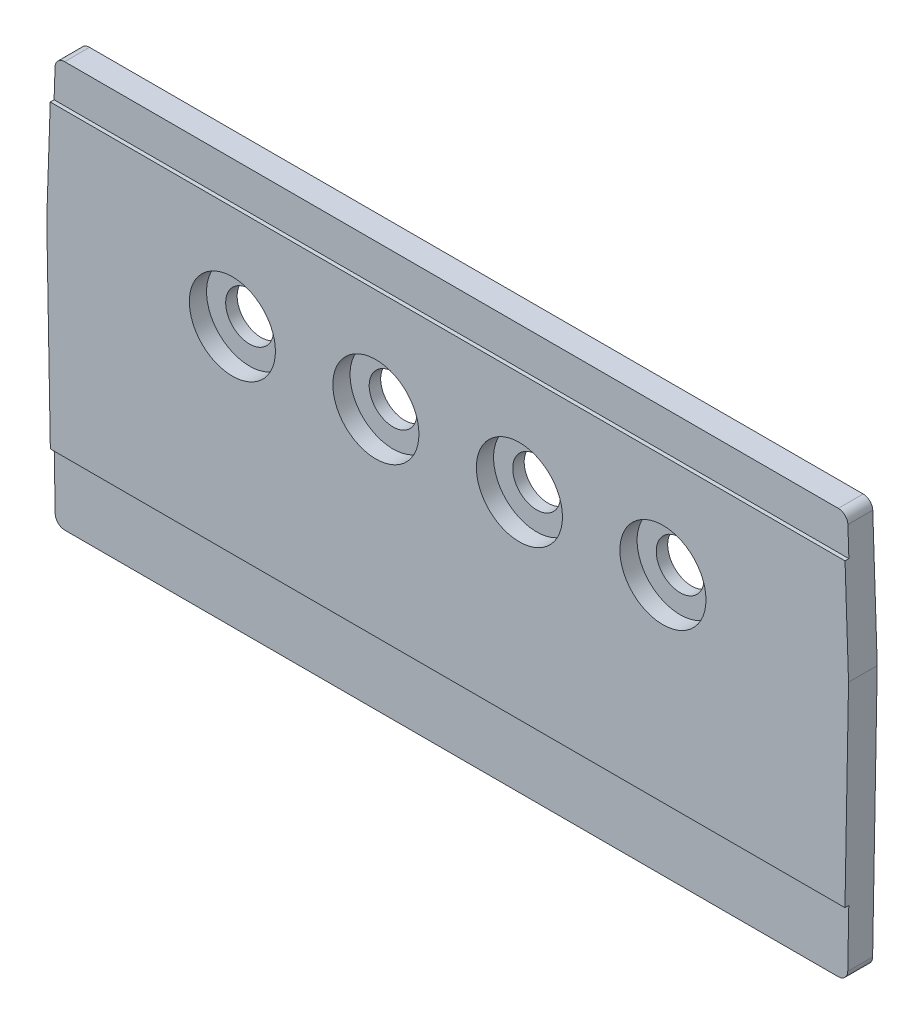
ISO-10303-21;
HEADER;
FILE_DESCRIPTION(('STEP AP214'),'2;1');
FILE_NAME('part.step','',(''),(''),'','','');
FILE_SCHEMA(('AUTOMOTIVE_DESIGN { 1 0 10303 214 1 1 1 1 }'));
ENDSEC;
DATA;
#1=APPLICATION_CONTEXT('core data for automotive mechanical design processes');
#2=APPLICATION_PROTOCOL_DEFINITION('international standard','automotive_design',2000,#1);
#3=PRODUCT_CONTEXT('',#1,'mechanical');
#4=PRODUCT('Part','Part','',(#3));
#5=PRODUCT_RELATED_PRODUCT_CATEGORY('part','',(#4));
#6=PRODUCT_DEFINITION_FORMATION('','',#4);
#7=PRODUCT_DEFINITION_CONTEXT('part definition',#1,'design');
#8=PRODUCT_DEFINITION('design','',#6,#7);
#9=PRODUCT_DEFINITION_SHAPE('','',#8);
#10=(LENGTH_UNIT() NAMED_UNIT(*) SI_UNIT(.MILLI.,.METRE.));
#11=(NAMED_UNIT(*) PLANE_ANGLE_UNIT() SI_UNIT($,.RADIAN.));
#12=(NAMED_UNIT(*) SI_UNIT($,.STERADIAN.) SOLID_ANGLE_UNIT());
#13=UNCERTAINTY_MEASURE_WITH_UNIT(LENGTH_MEASURE(1.E-05),#10,'distance_accuracy_value','');
#14=(GEOMETRIC_REPRESENTATION_CONTEXT(3) GLOBAL_UNCERTAINTY_ASSIGNED_CONTEXT((#13)) GLOBAL_UNIT_ASSIGNED_CONTEXT((#10,
#11,#12)) REPRESENTATION_CONTEXT('',''));
#15=CARTESIAN_POINT('',(0.,0.,0.));
#16=DIRECTION('',(0.,0.,1.));
#17=DIRECTION('',(1.,0.,0.));
#18=AXIS2_PLACEMENT_3D('',#15,#16,#17);
#19=CARTESIAN_POINT('',(82.3179518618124,1.,3.));
#20=DIRECTION('',(0.,0.,-1.));
#21=DIRECTION('',(-1.,0.,0.));
#22=AXIS2_PLACEMENT_3D('',#19,#20,#21);
#23=CYLINDRICAL_SURFACE('',#22,1.);
#24=CARTESIAN_POINT('',(82.3179518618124,1.,2.6));
#25=DIRECTION('',(0.,0.,1.));
#26=DIRECTION('',(1.,0.,0.));
#27=AXIS2_PLACEMENT_3D('',#24,#25,#26);
#28=CIRCLE('',#27,1.);
#29=CARTESIAN_POINT('',(82.3179518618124,0.,2.6));
#30=VERTEX_POINT('',#29);
#31=CARTESIAN_POINT('',(83.3177878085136,0.981887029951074,2.6));
#32=VERTEX_POINT('',#31);
#33=EDGE_CURVE('E143',#30,#32,#28,.T.);
#34=ORIENTED_EDGE('',*,*,#33,.F.);
#35=DIRECTION('',(0.,0.,-1.));
#36=VECTOR('',#35,1.);
#37=CARTESIAN_POINT('',(82.3179518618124,0.,3.));
#38=LINE('',#37,#36);
#39=CARTESIAN_POINT('',(82.3179518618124,0.,0.));
#40=VERTEX_POINT('',#39);
#41=EDGE_CURVE('E172',#30,#40,#38,.T.);
#42=ORIENTED_EDGE('',*,*,#41,.T.);
#43=CARTESIAN_POINT('',(82.3179518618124,1.,0.));
#44=DIRECTION('',(0.,0.,1.));
#45=DIRECTION('',(-1.,0.,0.));
#46=AXIS2_PLACEMENT_3D('',#43,#44,#45);
#47=CIRCLE('',#46,1.);
#48=CARTESIAN_POINT('',(83.3177878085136,0.981887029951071,0.));
#49=VERTEX_POINT('',#48);
#50=EDGE_CURVE('E173',#40,#49,#47,.T.);
#51=ORIENTED_EDGE('',*,*,#50,.T.);
#52=DIRECTION('',(0.,0.,-1.));
#53=VECTOR('',#52,1.);
#54=CARTESIAN_POINT('',(83.3177878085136,0.981887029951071,3.));
#55=LINE('',#54,#53);
#56=EDGE_CURVE('E214',#32,#49,#55,.T.);
#57=ORIENTED_EDGE('',*,*,#56,.F.);
#58=EDGE_LOOP('',(#34,#42,#51,#57));
#59=FACE_BOUND('',#58,.T.);
#60=ADVANCED_FACE('F33',(#59),#23,.T.);
#61=CARTESIAN_POINT('',(1.48204813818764,1.,3.));
#62=DIRECTION('',(0.,0.,-1.));
#63=DIRECTION('',(-1.,0.,0.));
#64=AXIS2_PLACEMENT_3D('',#61,#62,#63);
#65=CYLINDRICAL_SURFACE('',#64,1.);
#66=CARTESIAN_POINT('',(1.48204813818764,1.,2.6));
#67=DIRECTION('',(0.,0.,1.));
#68=DIRECTION('',(1.,0.,0.));
#69=AXIS2_PLACEMENT_3D('',#66,#67,#68);
#70=CIRCLE('',#69,1.);
#71=CARTESIAN_POINT('',(0.482212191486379,0.981887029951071,2.6));
#72=VERTEX_POINT('',#71);
#73=CARTESIAN_POINT('',(1.48204813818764,0.,2.6));
#74=VERTEX_POINT('',#73);
#75=EDGE_CURVE('E47',#72,#74,#70,.T.);
#76=ORIENTED_EDGE('',*,*,#75,.F.);
#77=DIRECTION('',(0.,0.,-1.));
#78=VECTOR('',#77,1.);
#79=CARTESIAN_POINT('',(0.482212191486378,0.981887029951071,3.));
#80=LINE('',#79,#78);
#81=CARTESIAN_POINT('',(0.482212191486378,0.981887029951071,0.));
#82=VERTEX_POINT('',#81);
#83=EDGE_CURVE('E200',#72,#82,#80,.T.);
#84=ORIENTED_EDGE('',*,*,#83,.T.);
#85=CARTESIAN_POINT('',(1.48204813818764,1.,0.));
#86=DIRECTION('',(0.,0.,1.));
#87=DIRECTION('',(1.,0.,0.));
#88=AXIS2_PLACEMENT_3D('',#85,#86,#87);
#89=CIRCLE('',#88,1.);
#90=CARTESIAN_POINT('',(1.48204813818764,0.,0.));
#91=VERTEX_POINT('',#90);
#92=EDGE_CURVE('E164',#82,#91,#89,.T.);
#93=ORIENTED_EDGE('',*,*,#92,.T.);
#94=DIRECTION('',(0.,0.,-1.));
#95=VECTOR('',#94,1.);
#96=CARTESIAN_POINT('',(1.48204813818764,0.,3.));
#97=LINE('',#96,#95);
#98=EDGE_CURVE('E198',#74,#91,#97,.T.);
#99=ORIENTED_EDGE('',*,*,#98,.F.);
#100=EDGE_LOOP('',(#76,#84,#93,#99));
#101=FACE_BOUND('',#100,.T.);
#102=ADVANCED_FACE('F354',(#101),#65,.T.);
#103=CARTESIAN_POINT('',(1.48204813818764,0.,3.));
#104=DIRECTION('',(0.,1.,0.));
#105=DIRECTION('',(0.,0.,1.));
#106=AXIS2_PLACEMENT_3D('',#103,#104,#105);
#107=PLANE('',#106);
#108=DIRECTION('',(1.,0.,0.));
#109=VECTOR('',#108,1.);
#110=CARTESIAN_POINT('',(1.48204813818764,0.,2.6));
#111=LINE('',#110,#109);
#112=EDGE_CURVE('E40',#74,#30,#111,.T.);
#113=ORIENTED_EDGE('',*,*,#112,.F.);
#114=ORIENTED_EDGE('',*,*,#98,.T.);
#115=DIRECTION('',(1.,0.,0.));
#116=VECTOR('',#115,1.);
#117=CARTESIAN_POINT('',(1.48204813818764,0.,0.));
#118=LINE('',#117,#116);
#119=EDGE_CURVE('E159',#91,#40,#118,.T.);
#120=ORIENTED_EDGE('',*,*,#119,.T.);
#121=ORIENTED_EDGE('',*,*,#41,.F.);
#122=EDGE_LOOP('',(#113,#114,#120,#121));
#123=FACE_BOUND('',#122,.T.);
#124=ADVANCED_FACE('F249',(#123),#107,.F.);
#125=CARTESIAN_POINT('',(82.3332132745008,41.4,3.));
#126=DIRECTION('',(0.,0.,-1.));
#127=DIRECTION('',(-1.,0.,0.));
#128=AXIS2_PLACEMENT_3D('',#125,#126,#127);
#129=CYLINDRICAL_SURFACE('',#128,1.);
#130=CARTESIAN_POINT('',(82.3332132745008,41.4,2.6));
#131=DIRECTION('',(0.,0.,1.));
#132=DIRECTION('',(1.,0.,0.));
#133=AXIS2_PLACEMENT_3D('',#130,#131,#132);
#134=CIRCLE('',#133,1.);
#135=CARTESIAN_POINT('',(83.3326430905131,41.4337645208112,2.6));
#136=VERTEX_POINT('',#135);
#137=CARTESIAN_POINT('',(82.3332132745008,42.4,2.6));
#138=VERTEX_POINT('',#137);
#139=EDGE_CURVE('E290',#136,#138,#134,.T.);
#140=ORIENTED_EDGE('',*,*,#139,.F.);
#141=DIRECTION('',(0.,0.,-1.));
#142=VECTOR('',#141,1.);
#143=CARTESIAN_POINT('',(83.3326430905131,41.4337645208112,3.));
#144=LINE('',#143,#142);
#145=CARTESIAN_POINT('',(83.3326430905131,41.4337645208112,0.));
#146=VERTEX_POINT('',#145);
#147=EDGE_CURVE('E211',#136,#146,#144,.T.);
#148=ORIENTED_EDGE('',*,*,#147,.T.);
#149=CARTESIAN_POINT('',(82.3332132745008,41.4,0.));
#150=DIRECTION('',(0.,0.,1.));
#151=DIRECTION('',(1.,0.,0.));
#152=AXIS2_PLACEMENT_3D('',#149,#150,#151);
#153=CIRCLE('',#152,1.);
#154=CARTESIAN_POINT('',(82.3332132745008,42.4,0.));
#155=VERTEX_POINT('',#154);
#156=EDGE_CURVE('E181',#146,#155,#153,.T.);
#157=ORIENTED_EDGE('',*,*,#156,.T.);
#158=DIRECTION('',(0.,0.,-1.));
#159=VECTOR('',#158,1.);
#160=CARTESIAN_POINT('',(82.3332132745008,42.4,3.));
#161=LINE('',#160,#159);
#162=EDGE_CURVE('E209',#138,#155,#161,.T.);
#163=ORIENTED_EDGE('',*,*,#162,.F.);
#164=EDGE_LOOP('',(#140,#148,#157,#163));
#165=FACE_BOUND('',#164,.T.);
#166=ADVANCED_FACE('F363',(#165),#129,.T.);
#167=CARTESIAN_POINT('',(1.46678672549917,42.4,3.));
#168=DIRECTION('',(0.,-1.,0.));
#169=DIRECTION('',(0.,0.,-1.));
#170=AXIS2_PLACEMENT_3D('',#167,#168,#169);
#171=PLANE('',#170);
#172=DIRECTION('',(-1.,0.,0.));
#173=VECTOR('',#172,1.);
#174=CARTESIAN_POINT('',(-0.630436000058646,42.4,2.6));
#175=LINE('',#174,#173);
#176=CARTESIAN_POINT('',(1.46678672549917,42.4,2.6));
#177=VERTEX_POINT('',#176);
#178=EDGE_CURVE('E287',#138,#177,#175,.T.);
#179=ORIENTED_EDGE('',*,*,#178,.F.);
#180=ORIENTED_EDGE('',*,*,#162,.T.);
#181=DIRECTION('',(-1.,0.,0.));
#182=VECTOR('',#181,1.);
#183=CARTESIAN_POINT('',(1.46678672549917,42.4,0.));
#184=LINE('',#183,#182);
#185=CARTESIAN_POINT('',(1.46678672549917,42.4,0.));
#186=VERTEX_POINT('',#185);
#187=EDGE_CURVE('E184',#155,#186,#184,.T.);
#188=ORIENTED_EDGE('',*,*,#187,.T.);
#189=DIRECTION('',(0.,0.,-1.));
#190=VECTOR('',#189,1.);
#191=CARTESIAN_POINT('',(1.46678672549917,42.4,3.));
#192=LINE('',#191,#190);
#193=EDGE_CURVE('E207',#177,#186,#192,.T.);
#194=ORIENTED_EDGE('',*,*,#193,.F.);
#195=EDGE_LOOP('',(#179,#180,#188,#194));
#196=FACE_BOUND('',#195,.T.);
#197=ADVANCED_FACE('F374',(#196),#171,.F.);
#198=CARTESIAN_POINT('',(1.46678672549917,41.4,3.));
#199=DIRECTION('',(0.,0.,-1.));
#200=DIRECTION('',(-1.,0.,0.));
#201=AXIS2_PLACEMENT_3D('',#198,#199,#200);
#202=CYLINDRICAL_SURFACE('',#201,1.);
#203=CARTESIAN_POINT('',(1.46678672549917,41.4,2.6));
#204=DIRECTION('',(0.,0.,1.));
#205=DIRECTION('',(1.,0.,0.));
#206=AXIS2_PLACEMENT_3D('',#203,#204,#205);
#207=CIRCLE('',#206,1.);
#208=CARTESIAN_POINT('',(0.467356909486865,41.4337645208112,2.6));
#209=VERTEX_POINT('',#208);
#210=EDGE_CURVE('E55',#177,#209,#207,.T.);
#211=ORIENTED_EDGE('',*,*,#210,.F.);
#212=ORIENTED_EDGE('',*,*,#193,.T.);
#213=CARTESIAN_POINT('',(1.46678672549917,41.4,0.));
#214=DIRECTION('',(0.,0.,1.));
#215=DIRECTION('',(-1.,0.,0.));
#216=AXIS2_PLACEMENT_3D('',#213,#214,#215);
#217=CIRCLE('',#216,1.);
#218=CARTESIAN_POINT('',(0.467356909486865,41.4337645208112,0.));
#219=VERTEX_POINT('',#218);
#220=EDGE_CURVE('E187',#186,#219,#217,.T.);
#221=ORIENTED_EDGE('',*,*,#220,.T.);
#222=DIRECTION('',(0.,0.,-1.));
#223=VECTOR('',#222,1.);
#224=CARTESIAN_POINT('',(0.467356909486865,41.4337645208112,3.));
#225=LINE('',#224,#223);
#226=EDGE_CURVE('E205',#209,#219,#225,.T.);
#227=ORIENTED_EDGE('',*,*,#226,.F.);
#228=EDGE_LOOP('',(#211,#212,#221,#227));
#229=FACE_BOUND('',#228,.T.);
#230=ADVANCED_FACE('F370',(#229),#202,.T.);
#231=CARTESIAN_POINT('',(64.4,27.6,3.));
#232=DIRECTION('',(0.,0.,-1.));
#233=DIRECTION('',(-1.,0.,0.));
#234=AXIS2_PLACEMENT_3D('',#231,#232,#233);
#235=CYLINDRICAL_SURFACE('',#234,2.50000000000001);
#236=CARTESIAN_POINT('',(64.4,27.6,0.));
#237=DIRECTION('',(0.,0.,1.));
#238=DIRECTION('',(1.,0.,0.));
#239=AXIS2_PLACEMENT_3D('',#236,#237,#238);
#240=CIRCLE('',#239,2.50000000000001);
#241=CARTESIAN_POINT('',(66.9,27.6,0.));
#242=VERTEX_POINT('',#241);
#243=EDGE_CURVE('E220',#242,#242,#240,.T.);
#244=ORIENTED_EDGE('',*,*,#243,.F.);
#245=EDGE_LOOP('',(#244));
#246=FACE_BOUND('',#245,.T.);
#247=CARTESIAN_POINT('',(64.4,27.6,1.2));
#248=DIRECTION('',(0.,0.,1.));
#249=DIRECTION('',(1.,0.,0.));
#250=AXIS2_PLACEMENT_3D('',#247,#248,#249);
#251=CIRCLE('',#250,2.50000000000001);
#252=CARTESIAN_POINT('',(66.9,27.6,1.2));
#253=VERTEX_POINT('',#252);
#254=EDGE_CURVE('E232',#253,#253,#251,.T.);
#255=ORIENTED_EDGE('',*,*,#254,.T.);
#256=EDGE_LOOP('',(#255));
#257=FACE_BOUND('',#256,.T.);
#258=ADVANCED_FACE('F373',(#246,#257),#235,.F.);
#259=CARTESIAN_POINT('',(49.4,27.6,3.));
#260=DIRECTION('',(0.,0.,-1.));
#261=DIRECTION('',(-1.,0.,0.));
#262=AXIS2_PLACEMENT_3D('',#259,#260,#261);
#263=CYLINDRICAL_SURFACE('',#262,2.5);
#264=CARTESIAN_POINT('',(49.4,27.6,0.));
#265=DIRECTION('',(0.,0.,1.));
#266=DIRECTION('',(1.,0.,0.));
#267=AXIS2_PLACEMENT_3D('',#264,#265,#266);
#268=CIRCLE('',#267,2.5);
#269=CARTESIAN_POINT('',(51.9,27.6,0.));
#270=VERTEX_POINT('',#269);
#271=EDGE_CURVE('E314',#270,#270,#268,.T.);
#272=ORIENTED_EDGE('',*,*,#271,.F.);
#273=EDGE_LOOP('',(#272));
#274=FACE_BOUND('',#273,.T.);
#275=CARTESIAN_POINT('',(49.4,27.6,1.2));
#276=DIRECTION('',(0.,0.,1.));
#277=DIRECTION('',(1.,0.,0.));
#278=AXIS2_PLACEMENT_3D('',#275,#276,#277);
#279=CIRCLE('',#278,2.5);
#280=CARTESIAN_POINT('',(51.9,27.6,1.2));
#281=VERTEX_POINT('',#280);
#282=EDGE_CURVE('E227',#281,#281,#279,.T.);
#283=ORIENTED_EDGE('',*,*,#282,.T.);
#284=EDGE_LOOP('',(#283));
#285=FACE_BOUND('',#284,.T.);
#286=ADVANCED_FACE('F542',(#274,#285),#263,.F.);
#287=CARTESIAN_POINT('',(34.4,27.6,3.));
#288=DIRECTION('',(0.,0.,-1.));
#289=DIRECTION('',(-1.,0.,0.));
#290=AXIS2_PLACEMENT_3D('',#287,#288,#289);
#291=CYLINDRICAL_SURFACE('',#290,2.5);
#292=CARTESIAN_POINT('',(34.4,27.6,0.));
#293=DIRECTION('',(0.,0.,1.));
#294=DIRECTION('',(1.,0.,0.));
#295=AXIS2_PLACEMENT_3D('',#292,#293,#294);
#296=CIRCLE('',#295,2.5);
#297=CARTESIAN_POINT('',(36.9,27.6,0.));
#298=VERTEX_POINT('',#297);
#299=EDGE_CURVE('E316',#298,#298,#296,.T.);
#300=ORIENTED_EDGE('',*,*,#299,.F.);
#301=EDGE_LOOP('',(#300));
#302=FACE_BOUND('',#301,.T.);
#303=CARTESIAN_POINT('',(34.4,27.6,1.2));
#304=DIRECTION('',(0.,0.,1.));
#305=DIRECTION('',(1.,0.,0.));
#306=AXIS2_PLACEMENT_3D('',#303,#304,#305);
#307=CIRCLE('',#306,2.5);
#308=CARTESIAN_POINT('',(36.9,27.6,1.2));
#309=VERTEX_POINT('',#308);
#310=EDGE_CURVE('E222',#309,#309,#307,.T.);
#311=ORIENTED_EDGE('',*,*,#310,.T.);
#312=EDGE_LOOP('',(#311));
#313=FACE_BOUND('',#312,.T.);
#314=ADVANCED_FACE('F326',(#302,#313),#291,.F.);
#315=CARTESIAN_POINT('',(19.4,27.6,3.));
#316=DIRECTION('',(0.,0.,-1.));
#317=DIRECTION('',(-1.,0.,0.));
#318=AXIS2_PLACEMENT_3D('',#315,#316,#317);
#319=CYLINDRICAL_SURFACE('',#318,2.5);
#320=CARTESIAN_POINT('',(19.4,27.6,0.));
#321=DIRECTION('',(0.,0.,1.));
#322=DIRECTION('',(1.,0.,0.));
#323=AXIS2_PLACEMENT_3D('',#320,#321,#322);
#324=CIRCLE('',#323,2.5);
#325=CARTESIAN_POINT('',(21.9,27.6,0.));
#326=VERTEX_POINT('',#325);
#327=EDGE_CURVE('E167',#326,#326,#324,.T.);
#328=ORIENTED_EDGE('',*,*,#327,.F.);
#329=EDGE_LOOP('',(#328));
#330=FACE_BOUND('',#329,.T.);
#331=CARTESIAN_POINT('',(19.4,27.6,1.2));
#332=DIRECTION('',(0.,0.,1.));
#333=DIRECTION('',(1.,0.,0.));
#334=AXIS2_PLACEMENT_3D('',#331,#332,#333);
#335=CIRCLE('',#334,2.5);
#336=CARTESIAN_POINT('',(21.9,27.6,1.2));
#337=VERTEX_POINT('',#336);
#338=EDGE_CURVE('E217',#337,#337,#335,.T.);
#339=ORIENTED_EDGE('',*,*,#338,.T.);
#340=EDGE_LOOP('',(#339));
#341=FACE_BOUND('',#340,.T.);
#342=ADVANCED_FACE('F323',(#330,#341),#319,.F.);
#343=CARTESIAN_POINT('',(82.3179518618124,1.,3.));
#344=DIRECTION('',(0.,0.,-1.));
#345=DIRECTION('',(-1.,0.,0.));
#346=AXIS2_PLACEMENT_3D('',#343,#344,#345);
#347=PLANE('',#346);
#348=CARTESIAN_POINT('',(64.4,27.6,3.));
#349=DIRECTION('',(0.,0.,1.));
#350=DIRECTION('',(1.,0.,0.));
#351=AXIS2_PLACEMENT_3D('',#348,#349,#350);
#352=CIRCLE('',#351,4.5);
#353=CARTESIAN_POINT('',(68.9,27.6,3.));
#354=VERTEX_POINT('',#353);
#355=EDGE_CURVE('E295',#354,#354,#352,.T.);
#356=ORIENTED_EDGE('',*,*,#355,.F.);
#357=EDGE_LOOP('',(#356));
#358=FACE_BOUND('',#357,.T.);
#359=CARTESIAN_POINT('',(49.4,27.6,3.));
#360=DIRECTION('',(0.,0.,1.));
#361=DIRECTION('',(1.,0.,0.));
#362=AXIS2_PLACEMENT_3D('',#359,#360,#361);
#363=CIRCLE('',#362,4.5);
#364=CARTESIAN_POINT('',(53.9,27.6,3.));
#365=VERTEX_POINT('',#364);
#366=EDGE_CURVE('E235',#365,#365,#363,.T.);
#367=ORIENTED_EDGE('',*,*,#366,.F.);
#368=EDGE_LOOP('',(#367));
#369=FACE_BOUND('',#368,.T.);
#370=CARTESIAN_POINT('',(34.4,27.6,3.));
#371=DIRECTION('',(0.,0.,1.));
#372=DIRECTION('',(1.,0.,0.));
#373=AXIS2_PLACEMENT_3D('',#370,#371,#372);
#374=CIRCLE('',#373,4.5);
#375=CARTESIAN_POINT('',(38.9,27.6,3.));
#376=VERTEX_POINT('',#375);
#377=EDGE_CURVE('E230',#376,#376,#374,.T.);
#378=ORIENTED_EDGE('',*,*,#377,.F.);
#379=EDGE_LOOP('',(#378));
#380=FACE_BOUND('',#379,.T.);
#381=CARTESIAN_POINT('',(19.4,27.6,3.));
#382=DIRECTION('',(0.,0.,1.));
#383=DIRECTION('',(1.,0.,0.));
#384=AXIS2_PLACEMENT_3D('',#381,#382,#383);
#385=CIRCLE('',#384,4.5);
#386=CARTESIAN_POINT('',(23.9,27.6,3.));
#387=VERTEX_POINT('',#386);
#388=EDGE_CURVE('E225',#387,#387,#385,.T.);
#389=ORIENTED_EDGE('',*,*,#388,.F.);
#390=EDGE_LOOP('',(#389));
#391=FACE_BOUND('',#390,.T.);
#392=DIRECTION('',(0.0181129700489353,-0.999835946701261,0.));
#393=VECTOR('',#392,1.);
#394=CARTESIAN_POINT('',(0.,27.6,3.));
#395=LINE('',#394,#393);
#396=CARTESIAN_POINT('',(0.,27.6,3.));
#397=VERTEX_POINT('',#396);
#398=CARTESIAN_POINT('',(0.37318840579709,6.99999999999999,3.));
#399=VERTEX_POINT('',#398);
#400=EDGE_CURVE('E152',#397,#399,#395,.T.);
#401=ORIENTED_EDGE('',*,*,#400,.T.);
#402=DIRECTION('',(-1.,0.,0.));
#403=VECTOR('',#402,1.);
#404=CARTESIAN_POINT('',(-0.630436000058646,6.99999999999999,3.));
#405=LINE('',#404,#403);
#406=CARTESIAN_POINT('',(83.4268115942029,6.99999999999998,3.));
#407=VERTEX_POINT('',#406);
#408=EDGE_CURVE('E136',#407,#399,#405,.T.);
#409=ORIENTED_EDGE('',*,*,#408,.F.);
#410=DIRECTION('',(0.0181129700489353,0.999835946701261,0.));
#411=VECTOR('',#410,1.);
#412=CARTESIAN_POINT('',(83.8,27.6,3.));
#413=LINE('',#412,#411);
#414=CARTESIAN_POINT('',(83.8,27.6,3.));
#415=VERTEX_POINT('',#414);
#416=EDGE_CURVE('E149',#407,#415,#413,.T.);
#417=ORIENTED_EDGE('',*,*,#416,.T.);
#418=DIRECTION('',(-0.0337645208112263,0.999429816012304,0.));
#419=VECTOR('',#418,1.);
#420=CARTESIAN_POINT('',(83.3326430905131,41.4337645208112,3.));
#421=LINE('',#420,#419);
#422=CARTESIAN_POINT('',(83.4351351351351,38.4,3.));
#423=VERTEX_POINT('',#422);
#424=EDGE_CURVE('E158',#415,#423,#421,.T.);
#425=ORIENTED_EDGE('',*,*,#424,.T.);
#426=DIRECTION('',(1.,0.,0.));
#427=VECTOR('',#426,1.);
#428=CARTESIAN_POINT('',(-0.630436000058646,38.4,3.));
#429=LINE('',#428,#427);
#430=CARTESIAN_POINT('',(0.364864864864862,38.4,3.));
#431=VERTEX_POINT('',#430);
#432=EDGE_CURVE('E142',#431,#423,#429,.T.);
#433=ORIENTED_EDGE('',*,*,#432,.F.);
#434=DIRECTION('',(-0.0337645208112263,-0.999429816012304,0.));
#435=VECTOR('',#434,1.);
#436=CARTESIAN_POINT('',(0.467356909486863,41.4337645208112,3.));
#437=LINE('',#436,#435);
#438=EDGE_CURVE('E161',#431,#397,#437,.T.);
#439=ORIENTED_EDGE('',*,*,#438,.T.);
#440=EDGE_LOOP('',(#401,#409,#417,#425,#433,#439));
#441=FACE_BOUND('',#440,.T.);
#442=ADVANCED_FACE('F147',(#358,#369,#380,#391,#441),#347,.F.);
#443=CARTESIAN_POINT('',(82.3179518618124,1.,0.));
#444=DIRECTION('',(0.,0.,-1.));
#445=DIRECTION('',(-1.,0.,0.));
#446=AXIS2_PLACEMENT_3D('',#443,#444,#445);
#447=PLANE('',#446);
#448=ORIENTED_EDGE('',*,*,#271,.T.);
#449=EDGE_LOOP('',(#448));
#450=FACE_BOUND('',#449,.T.);
#451=ORIENTED_EDGE('',*,*,#327,.T.);
#452=EDGE_LOOP('',(#451));
#453=FACE_BOUND('',#452,.T.);
#454=ORIENTED_EDGE('',*,*,#50,.F.);
#455=ORIENTED_EDGE('',*,*,#119,.F.);
#456=ORIENTED_EDGE('',*,*,#92,.F.);
#457=DIRECTION('',(0.0181129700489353,-0.999835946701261,0.));
#458=VECTOR('',#457,1.);
#459=CARTESIAN_POINT('',(0.,27.6,0.));
#460=LINE('',#459,#458);
#461=CARTESIAN_POINT('',(0.,27.6,0.));
#462=VERTEX_POINT('',#461);
#463=EDGE_CURVE('E192',#462,#82,#460,.T.);
#464=ORIENTED_EDGE('',*,*,#463,.F.);
#465=DIRECTION('',(-0.0337645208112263,-0.999429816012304,0.));
#466=VECTOR('',#465,1.);
#467=CARTESIAN_POINT('',(0.467356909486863,41.4337645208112,0.));
#468=LINE('',#467,#466);
#469=EDGE_CURVE('E190',#219,#462,#468,.T.);
#470=ORIENTED_EDGE('',*,*,#469,.F.);
#471=ORIENTED_EDGE('',*,*,#220,.F.);
#472=ORIENTED_EDGE('',*,*,#187,.F.);
#473=ORIENTED_EDGE('',*,*,#156,.F.);
#474=DIRECTION('',(-0.0337645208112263,0.999429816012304,0.));
#475=VECTOR('',#474,1.);
#476=CARTESIAN_POINT('',(83.3326430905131,41.4337645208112,0.));
#477=LINE('',#476,#475);
#478=CARTESIAN_POINT('',(83.8,27.6,0.));
#479=VERTEX_POINT('',#478);
#480=EDGE_CURVE('E178',#479,#146,#477,.T.);
#481=ORIENTED_EDGE('',*,*,#480,.F.);
#482=DIRECTION('',(0.0181129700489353,0.999835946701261,0.));
#483=VECTOR('',#482,1.);
#484=CARTESIAN_POINT('',(83.8,27.6,0.));
#485=LINE('',#484,#483);
#486=EDGE_CURVE('E176',#49,#479,#485,.T.);
#487=ORIENTED_EDGE('',*,*,#486,.F.);
#488=EDGE_LOOP('',(#454,#455,#456,#464,#470,#471,#472,#473,#481,#487));
#489=FACE_BOUND('',#488,.T.);
#490=ORIENTED_EDGE('',*,*,#299,.T.);
#491=EDGE_LOOP('',(#490));
#492=FACE_BOUND('',#491,.T.);
#493=ORIENTED_EDGE('',*,*,#243,.T.);
#494=EDGE_LOOP('',(#493));
#495=FACE_BOUND('',#494,.T.);
#496=ADVANCED_FACE('F255',(#450,#453,#489,#492,#495),#447,.T.);
#497=CARTESIAN_POINT('',(83.8,27.6,3.));
#498=DIRECTION('',(-0.999835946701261,0.0181129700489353,0.));
#499=DIRECTION('',(-0.0181129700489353,-0.999835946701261,0.));
#500=AXIS2_PLACEMENT_3D('',#497,#498,#499);
#501=PLANE('',#500);
#502=ORIENTED_EDGE('',*,*,#416,.F.);
#503=DIRECTION('',(0.,0.,-1.));
#504=VECTOR('',#503,1.);
#505=CARTESIAN_POINT('',(83.4268115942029,6.99999999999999,3.));
#506=LINE('',#505,#504);
#507=CARTESIAN_POINT('',(83.4268115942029,6.99999999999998,2.6));
#508=VERTEX_POINT('',#507);
#509=EDGE_CURVE('E133',#407,#508,#506,.T.);
#510=ORIENTED_EDGE('',*,*,#509,.T.);
#511=DIRECTION('',(0.0181129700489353,0.999835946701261,0.));
#512=VECTOR('',#511,1.);
#513=CARTESIAN_POINT('',(83.8,27.6,2.6));
#514=LINE('',#513,#512);
#515=EDGE_CURVE('E247',#32,#508,#514,.T.);
#516=ORIENTED_EDGE('',*,*,#515,.F.);
#517=ORIENTED_EDGE('',*,*,#56,.T.);
#518=ORIENTED_EDGE('',*,*,#486,.T.);
#519=DIRECTION('',(0.,0.,-1.));
#520=VECTOR('',#519,1.);
#521=CARTESIAN_POINT('',(83.8,27.6,3.));
#522=LINE('',#521,#520);
#523=EDGE_CURVE('E156',#415,#479,#522,.T.);
#524=ORIENTED_EDGE('',*,*,#523,.F.);
#525=EDGE_LOOP('',(#502,#510,#516,#517,#518,#524));
#526=FACE_BOUND('',#525,.T.);
#527=ADVANCED_FACE('F154',(#526),#501,.F.);
#528=CARTESIAN_POINT('',(83.3326430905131,41.4337645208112,3.));
#529=DIRECTION('',(-0.999429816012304,-0.0337645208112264,0.));
#530=DIRECTION('',(0.0337645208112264,-0.999429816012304,0.));
#531=AXIS2_PLACEMENT_3D('',#528,#529,#530);
#532=PLANE('',#531);
#533=DIRECTION('',(-0.0337645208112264,0.999429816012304,0.));
#534=VECTOR('',#533,1.);
#535=CARTESIAN_POINT('',(83.3326430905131,41.4337645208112,2.6));
#536=LINE('',#535,#534);
#537=CARTESIAN_POINT('',(83.4351351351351,38.4,2.6));
#538=VERTEX_POINT('',#537);
#539=EDGE_CURVE('E292',#538,#136,#536,.T.);
#540=ORIENTED_EDGE('',*,*,#539,.F.);
#541=DIRECTION('',(0.,0.,1.));
#542=VECTOR('',#541,1.);
#543=CARTESIAN_POINT('',(83.4351351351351,38.4,3.));
#544=LINE('',#543,#542);
#545=EDGE_CURVE('E264',#538,#423,#544,.T.);
#546=ORIENTED_EDGE('',*,*,#545,.T.);
#547=ORIENTED_EDGE('',*,*,#424,.F.);
#548=ORIENTED_EDGE('',*,*,#523,.T.);
#549=ORIENTED_EDGE('',*,*,#480,.T.);
#550=ORIENTED_EDGE('',*,*,#147,.F.);
#551=EDGE_LOOP('',(#540,#546,#547,#548,#549,#550));
#552=FACE_BOUND('',#551,.T.);
#553=ADVANCED_FACE('F261',(#552),#532,.F.);
#554=CARTESIAN_POINT('',(0.467356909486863,41.4337645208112,3.));
#555=DIRECTION('',(0.999429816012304,-0.0337645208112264,0.));
#556=DIRECTION('',(0.0337645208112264,0.999429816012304,0.));
#557=AXIS2_PLACEMENT_3D('',#554,#555,#556);
#558=PLANE('',#557);
#559=ORIENTED_EDGE('',*,*,#438,.F.);
#560=DIRECTION('',(0.,0.,-1.));
#561=VECTOR('',#560,1.);
#562=CARTESIAN_POINT('',(0.364864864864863,38.4,3.));
#563=LINE('',#562,#561);
#564=CARTESIAN_POINT('',(0.364864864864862,38.4,2.6));
#565=VERTEX_POINT('',#564);
#566=EDGE_CURVE('E238',#431,#565,#563,.T.);
#567=ORIENTED_EDGE('',*,*,#566,.T.);
#568=DIRECTION('',(-0.0337645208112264,-0.999429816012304,0.));
#569=VECTOR('',#568,1.);
#570=CARTESIAN_POINT('',(0.467356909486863,41.4337645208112,2.6));
#571=LINE('',#570,#569);
#572=EDGE_CURVE('E216',#209,#565,#571,.T.);
#573=ORIENTED_EDGE('',*,*,#572,.F.);
#574=ORIENTED_EDGE('',*,*,#226,.T.);
#575=ORIENTED_EDGE('',*,*,#469,.T.);
#576=DIRECTION('',(0.,0.,-1.));
#577=VECTOR('',#576,1.);
#578=CARTESIAN_POINT('',(0.,27.6,3.));
#579=LINE('',#578,#577);
#580=EDGE_CURVE('E202',#397,#462,#579,.T.);
#581=ORIENTED_EDGE('',*,*,#580,.F.);
#582=EDGE_LOOP('',(#559,#567,#573,#574,#575,#581));
#583=FACE_BOUND('',#582,.T.);
#584=ADVANCED_FACE('F272',(#583),#558,.F.);
#585=CARTESIAN_POINT('',(0.,27.6,3.));
#586=DIRECTION('',(0.999835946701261,0.0181129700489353,0.));
#587=DIRECTION('',(-0.0181129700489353,0.999835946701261,0.));
#588=AXIS2_PLACEMENT_3D('',#585,#586,#587);
#589=PLANE('',#588);
#590=DIRECTION('',(0.0181129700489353,-0.999835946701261,0.));
#591=VECTOR('',#590,1.);
#592=CARTESIAN_POINT('',(0.,27.6,2.6));
#593=LINE('',#592,#591);
#594=CARTESIAN_POINT('',(0.37318840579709,6.99999999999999,2.6));
#595=VERTEX_POINT('',#594);
#596=EDGE_CURVE('E279',#595,#72,#593,.T.);
#597=ORIENTED_EDGE('',*,*,#596,.F.);
#598=DIRECTION('',(0.,0.,1.));
#599=VECTOR('',#598,1.);
#600=CARTESIAN_POINT('',(0.37318840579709,6.99999999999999,3.));
#601=LINE('',#600,#599);
#602=EDGE_CURVE('E11',#595,#399,#601,.T.);
#603=ORIENTED_EDGE('',*,*,#602,.T.);
#604=ORIENTED_EDGE('',*,*,#400,.F.);
#605=ORIENTED_EDGE('',*,*,#580,.T.);
#606=ORIENTED_EDGE('',*,*,#463,.T.);
#607=ORIENTED_EDGE('',*,*,#83,.F.);
#608=EDGE_LOOP('',(#597,#603,#604,#605,#606,#607));
#609=FACE_BOUND('',#608,.T.);
#610=ADVANCED_FACE('F277',(#609),#589,.F.);
#611=CARTESIAN_POINT('',(19.4,27.6,1.2));
#612=DIRECTION('',(0.,0.,1.));
#613=DIRECTION('',(1.,0.,0.));
#614=AXIS2_PLACEMENT_3D('',#611,#612,#613);
#615=CYLINDRICAL_SURFACE('',#614,4.5);
#616=CARTESIAN_POINT('',(19.4,27.6,1.2));
#617=DIRECTION('',(0.,0.,1.));
#618=DIRECTION('',(1.,0.,0.));
#619=AXIS2_PLACEMENT_3D('',#616,#617,#618);
#620=CIRCLE('',#619,4.5);
#621=CARTESIAN_POINT('',(23.9,27.6,1.2));
#622=VERTEX_POINT('',#621);
#623=EDGE_CURVE('E221',#622,#622,#620,.T.);
#624=ORIENTED_EDGE('',*,*,#623,.F.);
#625=EDGE_LOOP('',(#624));
#626=FACE_BOUND('',#625,.T.);
#627=ORIENTED_EDGE('',*,*,#388,.T.);
#628=EDGE_LOOP('',(#627));
#629=FACE_BOUND('',#628,.T.);
#630=ADVANCED_FACE('F334',(#626,#629),#615,.F.);
#631=CARTESIAN_POINT('',(19.4,27.6,1.2));
#632=DIRECTION('',(0.,0.,1.));
#633=DIRECTION('',(1.,0.,0.));
#634=AXIS2_PLACEMENT_3D('',#631,#632,#633);
#635=PLANE('',#634);
#636=ORIENTED_EDGE('',*,*,#338,.F.);
#637=EDGE_LOOP('',(#636));
#638=FACE_BOUND('',#637,.T.);
#639=ORIENTED_EDGE('',*,*,#623,.T.);
#640=EDGE_LOOP('',(#639));
#641=FACE_BOUND('',#640,.T.);
#642=ADVANCED_FACE('F330',(#638,#641),#635,.T.);
#643=CARTESIAN_POINT('',(34.4,27.6,1.2));
#644=DIRECTION('',(0.,0.,1.));
#645=DIRECTION('',(1.,0.,0.));
#646=AXIS2_PLACEMENT_3D('',#643,#644,#645);
#647=CYLINDRICAL_SURFACE('',#646,4.5);
#648=CARTESIAN_POINT('',(34.4,27.6,1.2));
#649=DIRECTION('',(0.,0.,1.));
#650=DIRECTION('',(1.,0.,0.));
#651=AXIS2_PLACEMENT_3D('',#648,#649,#650);
#652=CIRCLE('',#651,4.5);
#653=CARTESIAN_POINT('',(38.9,27.6,1.2));
#654=VERTEX_POINT('',#653);
#655=EDGE_CURVE('E226',#654,#654,#652,.T.);
#656=ORIENTED_EDGE('',*,*,#655,.F.);
#657=EDGE_LOOP('',(#656));
#658=FACE_BOUND('',#657,.T.);
#659=ORIENTED_EDGE('',*,*,#377,.T.);
#660=EDGE_LOOP('',(#659));
#661=FACE_BOUND('',#660,.T.);
#662=ADVANCED_FACE('F333',(#658,#661),#647,.F.);
#663=CARTESIAN_POINT('',(34.4,27.6,1.2));
#664=DIRECTION('',(0.,0.,1.));
#665=DIRECTION('',(1.,0.,0.));
#666=AXIS2_PLACEMENT_3D('',#663,#664,#665);
#667=PLANE('',#666);
#668=ORIENTED_EDGE('',*,*,#310,.F.);
#669=EDGE_LOOP('',(#668));
#670=FACE_BOUND('',#669,.T.);
#671=ORIENTED_EDGE('',*,*,#655,.T.);
#672=EDGE_LOOP('',(#671));
#673=FACE_BOUND('',#672,.T.);
#674=ADVANCED_FACE('F416',(#670,#673),#667,.T.);
#675=CARTESIAN_POINT('',(49.4,27.6,1.2));
#676=DIRECTION('',(0.,0.,1.));
#677=DIRECTION('',(1.,0.,0.));
#678=AXIS2_PLACEMENT_3D('',#675,#676,#677);
#679=CYLINDRICAL_SURFACE('',#678,4.5);
#680=CARTESIAN_POINT('',(49.4,27.6,1.2));
#681=DIRECTION('',(0.,0.,1.));
#682=DIRECTION('',(1.,0.,0.));
#683=AXIS2_PLACEMENT_3D('',#680,#681,#682);
#684=CIRCLE('',#683,4.5);
#685=CARTESIAN_POINT('',(53.9,27.6,1.2));
#686=VERTEX_POINT('',#685);
#687=EDGE_CURVE('E231',#686,#686,#684,.T.);
#688=ORIENTED_EDGE('',*,*,#687,.F.);
#689=EDGE_LOOP('',(#688));
#690=FACE_BOUND('',#689,.T.);
#691=ORIENTED_EDGE('',*,*,#366,.T.);
#692=EDGE_LOOP('',(#691));
#693=FACE_BOUND('',#692,.T.);
#694=ADVANCED_FACE('F424',(#690,#693),#679,.F.);
#695=CARTESIAN_POINT('',(49.4,27.6,1.2));
#696=DIRECTION('',(0.,0.,1.));
#697=DIRECTION('',(1.,0.,0.));
#698=AXIS2_PLACEMENT_3D('',#695,#696,#697);
#699=PLANE('',#698);
#700=ORIENTED_EDGE('',*,*,#282,.F.);
#701=EDGE_LOOP('',(#700));
#702=FACE_BOUND('',#701,.T.);
#703=ORIENTED_EDGE('',*,*,#687,.T.);
#704=EDGE_LOOP('',(#703));
#705=FACE_BOUND('',#704,.T.);
#706=ADVANCED_FACE('F432',(#702,#705),#699,.T.);
#707=CARTESIAN_POINT('',(64.4,27.6,1.2));
#708=DIRECTION('',(0.,0.,1.));
#709=DIRECTION('',(1.,0.,0.));
#710=AXIS2_PLACEMENT_3D('',#707,#708,#709);
#711=CYLINDRICAL_SURFACE('',#710,4.5);
#712=CARTESIAN_POINT('',(64.4,27.6,1.2));
#713=DIRECTION('',(0.,0.,1.));
#714=DIRECTION('',(1.,0.,0.));
#715=AXIS2_PLACEMENT_3D('',#712,#713,#714);
#716=CIRCLE('',#715,4.5);
#717=CARTESIAN_POINT('',(68.9,27.6,1.2));
#718=VERTEX_POINT('',#717);
#719=EDGE_CURVE('E236',#718,#718,#716,.T.);
#720=ORIENTED_EDGE('',*,*,#719,.F.);
#721=EDGE_LOOP('',(#720));
#722=FACE_BOUND('',#721,.T.);
#723=ORIENTED_EDGE('',*,*,#355,.T.);
#724=EDGE_LOOP('',(#723));
#725=FACE_BOUND('',#724,.T.);
#726=ADVANCED_FACE('F440',(#722,#725),#711,.F.);
#727=CARTESIAN_POINT('',(64.4,27.6,1.2));
#728=DIRECTION('',(0.,0.,1.));
#729=DIRECTION('',(1.,0.,0.));
#730=AXIS2_PLACEMENT_3D('',#727,#728,#729);
#731=PLANE('',#730);
#732=ORIENTED_EDGE('',*,*,#254,.F.);
#733=EDGE_LOOP('',(#732));
#734=FACE_BOUND('',#733,.T.);
#735=ORIENTED_EDGE('',*,*,#719,.T.);
#736=EDGE_LOOP('',(#735));
#737=FACE_BOUND('',#736,.T.);
#738=ADVANCED_FACE('F448',(#734,#737),#731,.T.);
#739=CARTESIAN_POINT('',(-0.630436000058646,38.4,2.6));
#740=DIRECTION('',(0.,-1.,0.));
#741=DIRECTION('',(0.,0.,-1.));
#742=AXIS2_PLACEMENT_3D('',#739,#740,#741);
#743=PLANE('',#742);
#744=DIRECTION('',(1.,0.,0.));
#745=VECTOR('',#744,1.);
#746=CARTESIAN_POINT('',(-0.630436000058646,38.4,2.6));
#747=LINE('',#746,#745);
#748=EDGE_CURVE('E269',#565,#538,#747,.T.);
#749=ORIENTED_EDGE('',*,*,#748,.F.);
#750=ORIENTED_EDGE('',*,*,#566,.F.);
#751=ORIENTED_EDGE('',*,*,#432,.T.);
#752=ORIENTED_EDGE('',*,*,#545,.F.);
#753=EDGE_LOOP('',(#749,#750,#751,#752));
#754=FACE_BOUND('',#753,.T.);
#755=ADVANCED_FACE('F456',(#754),#743,.F.);
#756=CARTESIAN_POINT('',(-0.630436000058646,38.4,2.6));
#757=DIRECTION('',(0.,0.,1.));
#758=DIRECTION('',(1.,0.,0.));
#759=AXIS2_PLACEMENT_3D('',#756,#757,#758);
#760=PLANE('',#759);
#761=ORIENTED_EDGE('',*,*,#539,.T.);
#762=ORIENTED_EDGE('',*,*,#139,.T.);
#763=ORIENTED_EDGE('',*,*,#178,.T.);
#764=ORIENTED_EDGE('',*,*,#210,.T.);
#765=ORIENTED_EDGE('',*,*,#572,.T.);
#766=ORIENTED_EDGE('',*,*,#748,.T.);
#767=EDGE_LOOP('',(#761,#762,#763,#764,#765,#766));
#768=FACE_BOUND('',#767,.T.);
#769=ADVANCED_FACE('F463',(#768),#760,.T.);
#770=CARTESIAN_POINT('',(-0.630436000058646,6.99999999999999,2.6));
#771=DIRECTION('',(0.,1.,0.));
#772=DIRECTION('',(0.,0.,1.));
#773=AXIS2_PLACEMENT_3D('',#770,#771,#772);
#774=PLANE('',#773);
#775=ORIENTED_EDGE('',*,*,#408,.T.);
#776=ORIENTED_EDGE('',*,*,#602,.F.);
#777=DIRECTION('',(-1.,0.,0.));
#778=VECTOR('',#777,1.);
#779=CARTESIAN_POINT('',(-0.630436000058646,6.99999999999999,2.6));
#780=LINE('',#779,#778);
#781=EDGE_CURVE('E138',#508,#595,#780,.T.);
#782=ORIENTED_EDGE('',*,*,#781,.F.);
#783=ORIENTED_EDGE('',*,*,#509,.F.);
#784=EDGE_LOOP('',(#775,#776,#782,#783));
#785=FACE_BOUND('',#784,.T.);
#786=ADVANCED_FACE('F135',(#785),#774,.F.);
#787=CARTESIAN_POINT('',(-0.630436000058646,0.,2.6));
#788=DIRECTION('',(0.,0.,1.));
#789=DIRECTION('',(1.,0.,0.));
#790=AXIS2_PLACEMENT_3D('',#787,#788,#789);
#791=PLANE('',#790);
#792=ORIENTED_EDGE('',*,*,#33,.T.);
#793=ORIENTED_EDGE('',*,*,#515,.T.);
#794=ORIENTED_EDGE('',*,*,#781,.T.);
#795=ORIENTED_EDGE('',*,*,#596,.T.);
#796=ORIENTED_EDGE('',*,*,#75,.T.);
#797=ORIENTED_EDGE('',*,*,#112,.T.);
#798=EDGE_LOOP('',(#792,#793,#794,#795,#796,#797));
#799=FACE_BOUND('',#798,.T.);
#800=ADVANCED_FACE('F241',(#799),#791,.T.);
#801=CLOSED_SHELL('',(#60,#102,#124,#166,#197,#230,#258,#286,#314,#342,#442,#496,#527,#553,#584,
#610,#630,#642,#662,#674,#694,#706,#726,#738,#755,#769,#786,#800));
#802=MANIFOLD_SOLID_BREP('B2',#801);
#803=ADVANCED_BREP_SHAPE_REPRESENTATION('',(#18,#802),#14);
#804=SHAPE_DEFINITION_REPRESENTATION(#9,#803);
ENDSEC;
END-ISO-10303-21;
